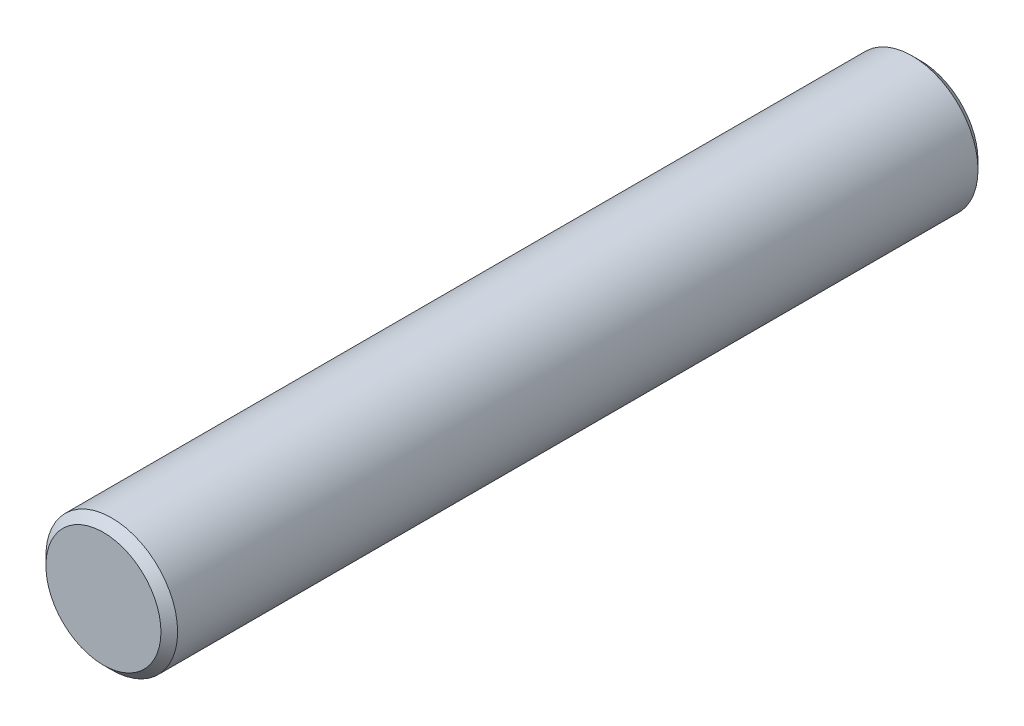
ISO-10303-21;
HEADER;
FILE_DESCRIPTION(('STEP AP214'),'2;1');
FILE_NAME('part.step','',(''),(''),'','','');
FILE_SCHEMA(('AUTOMOTIVE_DESIGN { 1 0 10303 214 1 1 1 1 }'));
ENDSEC;
DATA;
#1=APPLICATION_CONTEXT('core data for automotive mechanical design processes');
#2=APPLICATION_PROTOCOL_DEFINITION('international standard','automotive_design',2000,#1);
#3=PRODUCT_CONTEXT('',#1,'mechanical');
#4=PRODUCT('Part','Part','',(#3));
#5=PRODUCT_RELATED_PRODUCT_CATEGORY('part','',(#4));
#6=PRODUCT_DEFINITION_FORMATION('','',#4);
#7=PRODUCT_DEFINITION_CONTEXT('part definition',#1,'design');
#8=PRODUCT_DEFINITION('design','',#6,#7);
#9=PRODUCT_DEFINITION_SHAPE('','',#8);
#10=(LENGTH_UNIT() NAMED_UNIT(*) SI_UNIT(.MILLI.,.METRE.));
#11=(NAMED_UNIT(*) PLANE_ANGLE_UNIT() SI_UNIT($,.RADIAN.));
#12=(NAMED_UNIT(*) SI_UNIT($,.STERADIAN.) SOLID_ANGLE_UNIT());
#13=UNCERTAINTY_MEASURE_WITH_UNIT(LENGTH_MEASURE(1.E-05),#10,'distance_accuracy_value','');
#14=(GEOMETRIC_REPRESENTATION_CONTEXT(3) GLOBAL_UNCERTAINTY_ASSIGNED_CONTEXT((#13)) GLOBAL_UNIT_ASSIGNED_CONTEXT((#10,
#11,#12)) REPRESENTATION_CONTEXT('',''));
#15=CARTESIAN_POINT('',(0.,0.,0.));
#16=DIRECTION('',(0.,0.,1.));
#17=DIRECTION('',(1.,0.,0.));
#18=AXIS2_PLACEMENT_3D('',#15,#16,#17);
#19=CARTESIAN_POINT('',(0.,0.,24.5));
#20=DIRECTION('',(0.,0.,-1.));
#21=DIRECTION('',(-1.,0.,0.));
#22=AXIS2_PLACEMENT_3D('',#19,#20,#21);
#23=CYLINDRICAL_SURFACE('',#22,3.95);
#24=CARTESIAN_POINT('',(0.,0.,-24.));
#25=DIRECTION('',(0.,0.,1.));
#26=DIRECTION('',(1.,0.,0.));
#27=AXIS2_PLACEMENT_3D('',#24,#25,#26);
#28=CIRCLE('',#27,3.95);
#29=CARTESIAN_POINT('',(3.95,0.,-24.));
#30=VERTEX_POINT('',#29);
#31=EDGE_CURVE('E55',#30,#30,#28,.T.);
#32=ORIENTED_EDGE('',*,*,#31,.T.);
#33=EDGE_LOOP('',(#32));
#34=FACE_BOUND('',#33,.T.);
#35=CARTESIAN_POINT('',(0.,0.,24.));
#36=DIRECTION('',(0.,0.,1.));
#37=DIRECTION('',(1.,0.,0.));
#38=AXIS2_PLACEMENT_3D('',#35,#36,#37);
#39=CIRCLE('',#38,3.95);
#40=CARTESIAN_POINT('',(3.95,0.,24.));
#41=VERTEX_POINT('',#40);
#42=EDGE_CURVE('E61',#41,#41,#39,.F.);
#43=ORIENTED_EDGE('',*,*,#42,.T.);
#44=EDGE_LOOP('',(#43));
#45=FACE_BOUND('',#44,.T.);
#46=ADVANCED_FACE('F41',(#34,#45),#23,.T.);
#47=CARTESIAN_POINT('',(0.,0.,24.5));
#48=DIRECTION('',(0.,0.,1.));
#49=DIRECTION('',(1.,0.,0.));
#50=AXIS2_PLACEMENT_3D('',#47,#48,#49);
#51=PLANE('',#50);
#52=CARTESIAN_POINT('',(0.,0.,24.5));
#53=DIRECTION('',(0.,0.,1.));
#54=DIRECTION('',(1.,0.,0.));
#55=AXIS2_PLACEMENT_3D('',#52,#53,#54);
#56=CIRCLE('',#55,3.45);
#57=CARTESIAN_POINT('',(3.45,0.,24.5));
#58=VERTEX_POINT('',#57);
#59=EDGE_CURVE('E10',#58,#58,#56,.T.);
#60=ORIENTED_EDGE('',*,*,#59,.T.);
#61=EDGE_LOOP('',(#60));
#62=FACE_BOUND('',#61,.T.);
#63=ADVANCED_FACE('F79',(#62),#51,.T.);
#64=CARTESIAN_POINT('',(0.,0.,-24.5));
#65=DIRECTION('',(0.,0.,1.));
#66=DIRECTION('',(1.,0.,0.));
#67=AXIS2_PLACEMENT_3D('',#64,#65,#66);
#68=PLANE('',#67);
#69=CARTESIAN_POINT('',(0.,0.,-24.5));
#70=DIRECTION('',(0.,0.,1.));
#71=DIRECTION('',(1.,0.,0.));
#72=AXIS2_PLACEMENT_3D('',#69,#70,#71);
#73=CIRCLE('',#72,3.44999999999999);
#74=CARTESIAN_POINT('',(3.44999999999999,0.,-24.5));
#75=VERTEX_POINT('',#74);
#76=EDGE_CURVE('E49',#75,#75,#73,.F.);
#77=ORIENTED_EDGE('',*,*,#76,.T.);
#78=EDGE_LOOP('',(#77));
#79=FACE_BOUND('',#78,.T.);
#80=ADVANCED_FACE('F76',(#79),#68,.F.);
#81=CARTESIAN_POINT('',(0.,0.,-24.));
#82=DIRECTION('',(0.,0.,1.));
#83=DIRECTION('',(1.,0.,0.));
#84=AXIS2_PLACEMENT_3D('',#81,#82,#83);
#85=CONICAL_SURFACE('',#84,3.95,0.785398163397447);
#86=ORIENTED_EDGE('',*,*,#76,.F.);
#87=EDGE_LOOP('',(#86));
#88=FACE_BOUND('',#87,.T.);
#89=ORIENTED_EDGE('',*,*,#31,.F.);
#90=EDGE_LOOP('',(#89));
#91=FACE_BOUND('',#90,.T.);
#92=ADVANCED_FACE('F72',(#88,#91),#85,.T.);
#93=CARTESIAN_POINT('',(0.,0.,24.5));
#94=DIRECTION('',(0.,0.,-1.));
#95=DIRECTION('',(-1.,0.,0.));
#96=AXIS2_PLACEMENT_3D('',#93,#94,#95);
#97=CONICAL_SURFACE('',#96,3.45,0.785398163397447);
#98=ORIENTED_EDGE('',*,*,#42,.F.);
#99=EDGE_LOOP('',(#98));
#100=FACE_BOUND('',#99,.T.);
#101=ORIENTED_EDGE('',*,*,#59,.F.);
#102=EDGE_LOOP('',(#101));
#103=FACE_BOUND('',#102,.T.);
#104=ADVANCED_FACE('F43',(#100,#103),#97,.T.);
#105=CLOSED_SHELL('',(#46,#63,#80,#92,#104));
#106=MANIFOLD_SOLID_BREP('B2',#105);
#107=ADVANCED_BREP_SHAPE_REPRESENTATION('',(#18,#106),#14);
#108=SHAPE_DEFINITION_REPRESENTATION(#9,#107);
ENDSEC;
END-ISO-10303-21;
